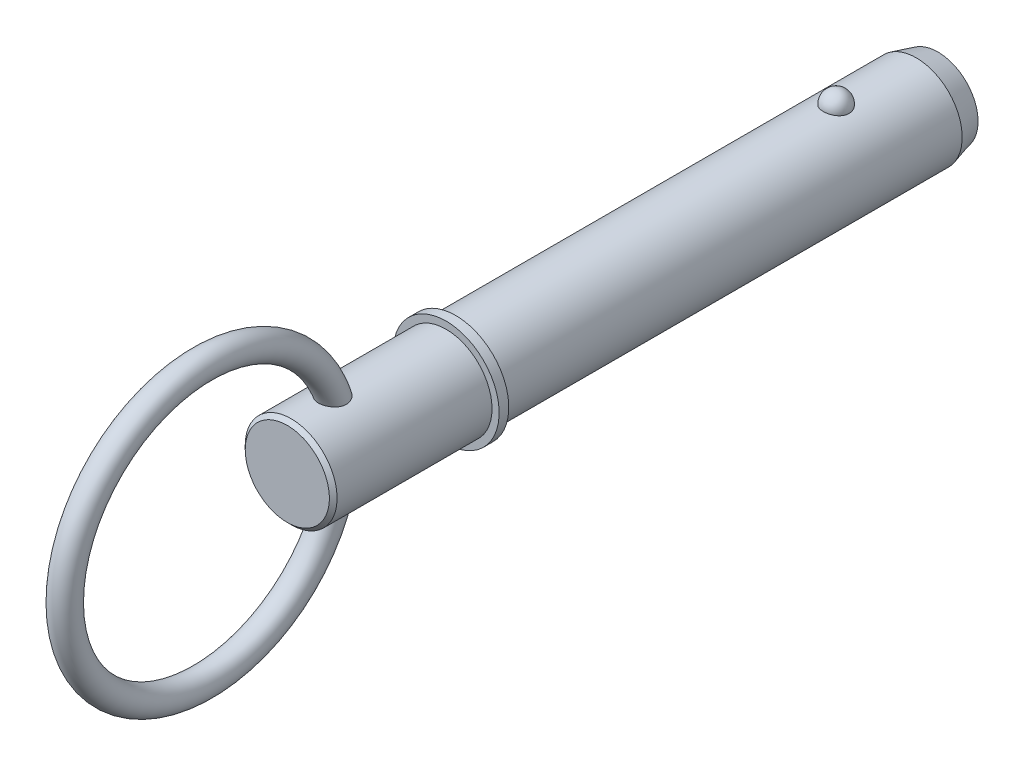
ISO-10303-21;
HEADER;
FILE_DESCRIPTION(('STEP AP214'),'2;1');
FILE_NAME('part.step','',(''),(''),'','','');
FILE_SCHEMA(('AUTOMOTIVE_DESIGN { 1 0 10303 214 1 1 1 1 }'));
ENDSEC;
DATA;
#1=APPLICATION_CONTEXT('core data for automotive mechanical design processes');
#2=APPLICATION_PROTOCOL_DEFINITION('international standard','automotive_design',2000,#1);
#3=PRODUCT_CONTEXT('',#1,'mechanical');
#4=PRODUCT('Part','Part','',(#3));
#5=PRODUCT_RELATED_PRODUCT_CATEGORY('part','',(#4));
#6=PRODUCT_DEFINITION_FORMATION('','',#4);
#7=PRODUCT_DEFINITION_CONTEXT('part definition',#1,'design');
#8=PRODUCT_DEFINITION('design','',#6,#7);
#9=PRODUCT_DEFINITION_SHAPE('','',#8);
#10=(LENGTH_UNIT() NAMED_UNIT(*) SI_UNIT(.MILLI.,.METRE.));
#11=(NAMED_UNIT(*) PLANE_ANGLE_UNIT() SI_UNIT($,.RADIAN.));
#12=(NAMED_UNIT(*) SI_UNIT($,.STERADIAN.) SOLID_ANGLE_UNIT());
#13=UNCERTAINTY_MEASURE_WITH_UNIT(LENGTH_MEASURE(1.E-05),#10,'distance_accuracy_value','');
#14=(GEOMETRIC_REPRESENTATION_CONTEXT(3) GLOBAL_UNCERTAINTY_ASSIGNED_CONTEXT((#13)) GLOBAL_UNIT_ASSIGNED_CONTEXT((#10,
#11,#12)) REPRESENTATION_CONTEXT('',''));
#15=CARTESIAN_POINT('',(0.,0.,0.));
#16=DIRECTION('',(0.,0.,1.));
#17=DIRECTION('',(1.,0.,0.));
#18=AXIS2_PLACEMENT_3D('',#15,#16,#17);
#19=CARTESIAN_POINT('',(0.,0.,76.2));
#20=DIRECTION('',(0.,0.,-1.));
#21=DIRECTION('',(-1.,0.,0.));
#22=AXIS2_PLACEMENT_3D('',#19,#20,#21);
#23=CYLINDRICAL_SURFACE('',#22,9.525);
#24=CARTESIAN_POINT('',(2.66304631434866,9.14515223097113,-2.69));
#25=CARTESIAN_POINT('',(2.66304388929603,9.14515434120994,-2.53964785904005));
#26=CARTESIAN_POINT('',(2.65079171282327,9.14874785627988,-2.389265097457));
#27=CARTESIAN_POINT('',(2.60207590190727,9.16272073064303,-2.09276319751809));
#28=CARTESIAN_POINT('',(2.5656035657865,9.17310252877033,-1.94664561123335));
#29=CARTESIAN_POINT('',(2.469373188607,9.19947238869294,-1.66290124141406));
#30=CARTESIAN_POINT('',(2.40962536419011,9.215457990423,-1.52527076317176));
#31=CARTESIAN_POINT('',(2.26832639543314,9.25124900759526,-1.26225231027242));
#32=CARTESIAN_POINT('',(2.1867756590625,9.27105435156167,-1.1368641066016));
#33=CARTESIAN_POINT('',(2.00344089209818,9.3123948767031,-0.901158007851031));
#34=CARTESIAN_POINT('',(1.90155748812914,9.33393823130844,-0.790918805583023));
#35=CARTESIAN_POINT('',(1.68043702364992,9.37626794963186,-0.589299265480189));
#36=CARTESIAN_POINT('',(1.56119995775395,9.397054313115,-0.497918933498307));
#37=CARTESIAN_POINT('',(1.30893044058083,9.43549335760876,-0.336812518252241));
#38=CARTESIAN_POINT('',(1.17593917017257,9.45315498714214,-0.267024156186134));
#39=CARTESIAN_POINT('',(0.899596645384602,9.48344056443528,-0.150749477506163));
#40=CARTESIAN_POINT('',(0.756246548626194,9.49606507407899,-0.10426056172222));
#41=CARTESIAN_POINT('',(0.466048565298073,9.51468193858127,-0.0365733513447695));
#42=CARTESIAN_POINT('',(0.319312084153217,9.52079100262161,-0.0149294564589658));
#43=CARTESIAN_POINT('',(0.0241592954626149,9.52611235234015,0.00395337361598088));
#44=CARTESIAN_POINT('',(-0.124256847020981,9.5253253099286,0.00119468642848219));
#45=CARTESIAN_POINT('',(-0.416281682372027,9.51700443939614,-0.0284230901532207));
#46=CARTESIAN_POINT('',(-0.559928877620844,9.50956858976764,-0.0549321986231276));
#47=CARTESIAN_POINT('',(-0.840604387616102,9.48887888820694,-0.130816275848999));
#48=CARTESIAN_POINT('',(-0.977632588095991,9.47562493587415,-0.180191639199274));
#49=CARTESIAN_POINT('',(-1.24212223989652,9.44460733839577,-0.300803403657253));
#50=CARTESIAN_POINT('',(-1.36952298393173,9.42681774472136,-0.372166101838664));
#51=CARTESIAN_POINT('',(-1.61053183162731,9.38864858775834,-0.534729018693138));
#52=CARTESIAN_POINT('',(-1.72413851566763,9.36826875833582,-0.625931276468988));
#53=CARTESIAN_POINT('',(-1.9367483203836,9.32666137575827,-0.827716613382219));
#54=CARTESIAN_POINT('',(-2.03542624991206,9.3054250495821,-0.938640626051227));
#55=CARTESIAN_POINT('',(-2.21301001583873,9.26480083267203,-1.17562728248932));
#56=CARTESIAN_POINT('',(-2.29191442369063,9.24541307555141,-1.30169101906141));
#57=CARTESIAN_POINT('',(-2.4288038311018,9.21040769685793,-1.56709947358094));
#58=CARTESIAN_POINT('',(-2.48653332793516,9.19483682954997,-1.7065822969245));
#59=CARTESIAN_POINT('',(-2.57830950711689,9.16952722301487,-1.9936348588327));
#60=CARTESIAN_POINT('',(-2.61235688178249,9.1597883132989,-2.14120436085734));
#61=CARTESIAN_POINT('',(-2.65582131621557,9.14728131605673,-2.43957517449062));
#62=CARTESIAN_POINT('',(-2.66534248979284,9.14448376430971,-2.59036007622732));
#63=CARTESIAN_POINT('',(-2.659816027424,9.1460926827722,-2.89143694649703));
#64=CARTESIAN_POINT('',(-2.64476907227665,9.15049895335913,-3.04172892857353));
#65=CARTESIAN_POINT('',(-2.59062526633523,9.16597303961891,-3.3367616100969));
#66=CARTESIAN_POINT('',(-2.55165119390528,9.17700684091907,-3.48152666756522));
#67=CARTESIAN_POINT('',(-2.45072334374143,9.20447158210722,-3.76226728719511));
#68=CARTESIAN_POINT('',(-2.38876863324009,9.22090274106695,-3.89824249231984));
#69=CARTESIAN_POINT('',(-2.24300082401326,9.25744165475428,-4.15838266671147));
#70=CARTESIAN_POINT('',(-2.15906901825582,9.27756919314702,-4.28247834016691));
#71=CARTESIAN_POINT('',(-1.97161008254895,9.31920445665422,-4.51460755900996));
#72=CARTESIAN_POINT('',(-1.86808218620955,9.34071223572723,-4.62264047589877));
#73=CARTESIAN_POINT('',(-1.64365852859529,9.38280712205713,-4.82005417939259));
#74=CARTESIAN_POINT('',(-1.52269814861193,9.40339041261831,-4.90936239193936));
#75=CARTESIAN_POINT('',(-1.26696810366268,9.44124442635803,-5.06628635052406));
#76=CARTESIAN_POINT('',(-1.13219941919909,9.45851538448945,-5.13390363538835));
#77=CARTESIAN_POINT('',(-0.854427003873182,9.48761400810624,-5.24478918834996));
#78=CARTESIAN_POINT('',(-0.711548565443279,9.49950757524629,-5.28835378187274));
#79=CARTESIAN_POINT('',(-0.420167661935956,9.51684639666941,-5.35116010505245));
#80=CARTESIAN_POINT('',(-0.271665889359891,9.52229244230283,-5.3704048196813));
#81=CARTESIAN_POINT('',(0.0236961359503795,9.52609381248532,-5.38387805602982));
#82=CARTESIAN_POINT('',(0.170533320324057,9.52458300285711,-5.37857884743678));
#83=CARTESIAN_POINT('',(0.461166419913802,9.51494050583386,-5.34419624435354));
#84=CARTESIAN_POINT('',(0.604962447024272,9.50680906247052,-5.31511372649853));
#85=CARTESIAN_POINT('',(0.884899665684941,9.48484202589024,-5.23415185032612));
#86=CARTESIAN_POINT('',(1.02106863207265,9.47102889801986,-5.18236222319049));
#87=CARTESIAN_POINT('',(1.28268503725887,9.43915933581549,-5.05742910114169));
#88=CARTESIAN_POINT('',(1.40813178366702,9.421102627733,-4.98428422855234));
#89=CARTESIAN_POINT('',(1.64690915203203,9.38233399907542,-4.81729201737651));
#90=CARTESIAN_POINT('',(1.76002050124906,9.36158508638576,-4.72313982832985));
#91=CARTESIAN_POINT('',(1.96897358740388,9.31987907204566,-4.5173244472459));
#92=CARTESIAN_POINT('',(2.06481234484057,9.29892193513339,-4.40565824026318));
#93=CARTESIAN_POINT('',(2.23837433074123,9.25869342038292,-4.16566572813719));
#94=CARTESIAN_POINT('',(2.31574652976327,9.23945848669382,-4.03707931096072));
#95=CARTESIAN_POINT('',(2.44818540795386,9.20525491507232,-3.76840633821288));
#96=CARTESIAN_POINT('',(2.50325979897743,9.19028480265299,-3.62832377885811));
#97=CARTESIAN_POINT('',(2.58510224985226,9.16757716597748,-3.35610038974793));
#98=CARTESIAN_POINT('',(2.61427951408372,9.15923447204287,-3.22472833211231));
#99=CARTESIAN_POINT('',(2.6532524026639,9.14802112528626,-2.95891229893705));
#100=CARTESIAN_POINT('',(2.66304848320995,9.1451503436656,-2.82446839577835));
#101=CARTESIAN_POINT('',(2.66304631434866,9.14515223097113,-2.69));
#102=B_SPLINE_CURVE_WITH_KNOTS('',3,(#24,#25,#26,#27,#28,#29,#30,#31,#32,#33,#34,#35,#36,#37,
#38,#39,#40,#41,#42,#43,#44,#45,#46,#47,#48,#49,#50,#51,#52,#53,#54,#55,#56,#57,#58,#59,#60,#61,
#62,#63,#64,#65,#66,#67,#68,#69,#70,#71,#72,#73,#74,#75,#76,#77,#78,#79,#80,#81,#82,#83,#84,#85,
#86,#87,#88,#89,#90,#91,#92,#93,#94,#95,#96,#97,#98,#99,#100,#101),.UNSPECIFIED.,.T.,.F.,(4,2,2,
2,2,2,2,2,2,2,2,2,2,2,2,2,2,2,2,2,2,2,2,2,2,2,2,2,2,2,2,2,2,2,2,2,2,2,4),(0.,0.450573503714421,
0.901308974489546,1.35184682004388,1.80237623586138,2.25516399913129,2.70795190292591,
3.15942136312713,3.61084044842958,4.0540301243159,4.49717661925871,4.9338984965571,
5.37062791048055,5.80991423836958,6.24924573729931,6.69708004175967,7.1449466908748,
7.5980522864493,8.0511446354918,8.50231041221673,8.95346368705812,9.40232106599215,
9.85119666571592,10.3025487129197,10.7539184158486,11.2070064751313,11.6600623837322,
12.1074045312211,12.5546917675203,12.9934085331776,13.4321091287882,13.8690915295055,
14.3061021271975,14.7499227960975,15.1938199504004,15.6455814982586,16.0971866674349,
16.5001694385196,16.9031427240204),.UNSPECIFIED.);
#103=CARTESIAN_POINT('',(2.66304631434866,9.14515223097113,-2.69));
#104=VERTEX_POINT('',#103);
#105=EDGE_CURVE('E101',#104,#104,#102,.T.);
#106=ORIENTED_EDGE('',*,*,#105,.T.);
#107=EDGE_LOOP('',(#106));
#108=FACE_BOUND('',#107,.T.);
#109=CARTESIAN_POINT('',(0.,0.,-19.3000000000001));
#110=DIRECTION('',(0.,0.,-1.));
#111=DIRECTION('',(-1.,0.,0.));
#112=AXIS2_PLACEMENT_3D('',#109,#110,#111);
#113=CIRCLE('',#112,9.525);
#114=CARTESIAN_POINT('',(-9.525,0.,-19.3000000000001));
#115=VERTEX_POINT('',#114);
#116=EDGE_CURVE('E109',#115,#115,#113,.F.);
#117=ORIENTED_EDGE('',*,*,#116,.T.);
#118=EDGE_LOOP('',(#117));
#119=FACE_BOUND('',#118,.T.);
#120=CARTESIAN_POINT('',(0.,0.,76.2));
#121=DIRECTION('',(0.,0.,1.));
#122=DIRECTION('',(1.,0.,0.));
#123=AXIS2_PLACEMENT_3D('',#120,#121,#122);
#124=CIRCLE('',#123,9.525);
#125=CARTESIAN_POINT('',(9.525,0.,76.2));
#126=VERTEX_POINT('',#125);
#127=EDGE_CURVE('E107',#126,#126,#124,.T.);
#128=ORIENTED_EDGE('',*,*,#127,.F.);
#129=EDGE_LOOP('',(#128));
#130=FACE_BOUND('',#129,.T.);
#131=ADVANCED_FACE('F39',(#108,#119,#130),#23,.T.);
#132=CARTESIAN_POINT('',(0.,0.,-23.8));
#133=DIRECTION('',(0.,0.,-1.));
#134=DIRECTION('',(-1.,0.,0.));
#135=AXIS2_PLACEMENT_3D('',#132,#133,#134);
#136=PLANE('',#135);
#137=CARTESIAN_POINT('',(0.,0.,-23.8));
#138=DIRECTION('',(0.,0.,-1.));
#139=DIRECTION('',(-1.,0.,0.));
#140=AXIS2_PLACEMENT_3D('',#137,#138,#139);
#141=CIRCLE('',#140,8.31922863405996);
#142=CARTESIAN_POINT('',(-8.31922863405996,0.,-23.8));
#143=VERTEX_POINT('',#142);
#144=EDGE_CURVE('E142',#143,#143,#141,.T.);
#145=ORIENTED_EDGE('',*,*,#144,.T.);
#146=EDGE_LOOP('',(#145));
#147=FACE_BOUND('',#146,.T.);
#148=ADVANCED_FACE('F87',(#147),#136,.T.);
#149=CARTESIAN_POINT('',(0.,0.,-23.8));
#150=DIRECTION('',(0.,0.,1.));
#151=DIRECTION('',(1.,0.,0.));
#152=AXIS2_PLACEMENT_3D('',#149,#150,#151);
#153=CONICAL_SURFACE('',#152,8.31922863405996,0.26179938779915);
#154=ORIENTED_EDGE('',*,*,#116,.F.);
#155=EDGE_LOOP('',(#154));
#156=FACE_BOUND('',#155,.T.);
#157=ORIENTED_EDGE('',*,*,#144,.F.);
#158=EDGE_LOOP('',(#157));
#159=FACE_BOUND('',#158,.T.);
#160=ADVANCED_FACE('F93',(#156,#159),#153,.T.);
#161=CARTESIAN_POINT('',(0.,9.525,-2.69));
#162=DIRECTION('',(0.,1.,0.));
#163=DIRECTION('',(0.,0.,1.));
#164=AXIS2_PLACEMENT_3D('',#161,#162,#163);
#165=SPHERICAL_SURFACE('',#164,2.69);
#166=ORIENTED_EDGE('',*,*,#105,.F.);
#167=EDGE_LOOP('',(#166));
#168=FACE_BOUND('',#167,.T.);
#169=ADVANCED_FACE('F112',(#168),#165,.T.);
#170=CARTESIAN_POINT('',(0.,0.,76.2));
#171=DIRECTION('',(0.,0.,-1.));
#172=DIRECTION('',(-1.,0.,0.));
#173=AXIS2_PLACEMENT_3D('',#170,#171,#172);
#174=PLANE('',#173);
#175=ORIENTED_EDGE('',*,*,#127,.T.);
#176=EDGE_LOOP('',(#175));
#177=FACE_BOUND('',#176,.T.);
#178=CARTESIAN_POINT('',(0.,0.,76.2));
#179=DIRECTION('',(0.,0.,-1.));
#180=DIRECTION('',(-1.,0.,0.));
#181=AXIS2_PLACEMENT_3D('',#178,#179,#180);
#182=CIRCLE('',#181,11.);
#183=CARTESIAN_POINT('',(-11.,0.,76.2));
#184=VERTEX_POINT('',#183);
#185=EDGE_CURVE('E108',#184,#184,#182,.T.);
#186=ORIENTED_EDGE('',*,*,#185,.T.);
#187=EDGE_LOOP('',(#186));
#188=FACE_BOUND('',#187,.T.);
#189=ADVANCED_FACE('F116',(#177,#188),#174,.T.);
#190=CARTESIAN_POINT('',(0.,0.,33.7287874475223));
#191=DIRECTION('',(0.,0.,-1.));
#192=DIRECTION('',(-1.,0.,0.));
#193=AXIS2_PLACEMENT_3D('',#190,#191,#192);
#194=CYLINDRICAL_SURFACE('',#193,11.);
#195=CARTESIAN_POINT('',(0.,0.,78.2));
#196=DIRECTION('',(0.,0.,-1.));
#197=DIRECTION('',(-1.,0.,0.));
#198=AXIS2_PLACEMENT_3D('',#195,#196,#197);
#199=CIRCLE('',#198,11.);
#200=CARTESIAN_POINT('',(-11.,0.,78.2));
#201=VERTEX_POINT('',#200);
#202=EDGE_CURVE('E133',#201,#201,#199,.T.);
#203=ORIENTED_EDGE('',*,*,#202,.T.);
#204=EDGE_LOOP('',(#203));
#205=FACE_BOUND('',#204,.T.);
#206=ORIENTED_EDGE('',*,*,#185,.F.);
#207=EDGE_LOOP('',(#206));
#208=FACE_BOUND('',#207,.T.);
#209=ADVANCED_FACE('F120',(#205,#208),#194,.T.);
#210=CARTESIAN_POINT('',(0.,11.,78.2));
#211=DIRECTION('',(0.,0.,1.));
#212=DIRECTION('',(1.,0.,0.));
#213=AXIS2_PLACEMENT_3D('',#210,#211,#212);
#214=PLANE('',#213);
#215=CARTESIAN_POINT('',(0.,0.,78.2));
#216=DIRECTION('',(0.,0.,1.));
#217=DIRECTION('',(1.,0.,0.));
#218=AXIS2_PLACEMENT_3D('',#215,#216,#217);
#219=CIRCLE('',#218,9.525);
#220=CARTESIAN_POINT('',(9.525,0.,78.2));
#221=VERTEX_POINT('',#220);
#222=EDGE_CURVE('E111',#221,#221,#219,.T.);
#223=ORIENTED_EDGE('',*,*,#222,.F.);
#224=EDGE_LOOP('',(#223));
#225=FACE_BOUND('',#224,.T.);
#226=ORIENTED_EDGE('',*,*,#202,.F.);
#227=EDGE_LOOP('',(#226));
#228=FACE_BOUND('',#227,.T.);
#229=ADVANCED_FACE('F84',(#225,#228),#214,.T.);
#230=CARTESIAN_POINT('',(0.,0.,111.13));
#231=DIRECTION('',(0.,0.,-1.));
#232=DIRECTION('',(-1.,0.,0.));
#233=AXIS2_PLACEMENT_3D('',#230,#231,#232);
#234=CYLINDRICAL_SURFACE('',#233,9.525);
#235=CARTESIAN_POINT('',(-1.17255022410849,-9.45255262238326,99.1156813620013));
#236=CARTESIAN_POINT('',(-1.03279041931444,-9.46988901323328,99.0520581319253));
#237=CARTESIAN_POINT('',(-0.887457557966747,-9.48474288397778,99.0000360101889));
#238=CARTESIAN_POINT('',(-0.589790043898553,-9.50789357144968,98.9203017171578));
#239=CARTESIAN_POINT('',(-0.437456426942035,-9.51619135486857,98.8925859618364));
#240=CARTESIAN_POINT('',(-0.130095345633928,-9.52535230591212,98.862037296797));
#241=CARTESIAN_POINT('',(0.0249321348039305,-9.52621542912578,98.8592045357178));
#242=CARTESIAN_POINT('',(0.333291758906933,-9.5204161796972,98.8784804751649));
#243=CARTESIAN_POINT('',(0.486623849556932,-9.51375357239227,98.9005899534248));
#244=CARTESIAN_POINT('',(0.787326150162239,-9.49360162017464,98.9693091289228));
#245=CARTESIAN_POINT('',(0.934692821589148,-9.48010828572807,99.0159331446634));
#246=CARTESIAN_POINT('',(1.2191706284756,-9.44773819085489,99.132695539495));
#247=CARTESIAN_POINT('',(1.35628163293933,-9.42886136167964,99.2028342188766));
#248=CARTESIAN_POINT('',(1.61597534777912,-9.38783836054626,99.3648586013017));
#249=CARTESIAN_POINT('',(1.73859309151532,-9.36570037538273,99.4566901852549));
#250=CARTESIAN_POINT('',(1.96611924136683,-9.32059424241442,99.6599834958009));
#251=CARTESIAN_POINT('',(2.07103000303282,-9.29762620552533,99.7714426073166));
#252=CARTESIAN_POINT('',(2.25895856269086,-9.25375378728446,100.009567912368));
#253=CARTESIAN_POINT('',(2.34223089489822,-9.23282741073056,100.136029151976));
#254=CARTESIAN_POINT('',(2.48638570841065,-9.19505802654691,100.401654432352));
#255=CARTESIAN_POINT('',(2.54727152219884,-9.17821441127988,100.540816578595));
#256=CARTESIAN_POINT('',(2.64504150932,-9.15051673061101,100.826450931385));
#257=CARTESIAN_POINT('',(2.68213620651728,-9.13961026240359,100.97284631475));
#258=CARTESIAN_POINT('',(2.73308631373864,-9.1245038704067,101.269935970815));
#259=CARTESIAN_POINT('',(2.74693762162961,-9.12030513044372,101.420630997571));
#260=CARTESIAN_POINT('',(2.75225289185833,-9.11870262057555,101.728204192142));
#261=CARTESIAN_POINT('',(2.742835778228,-9.12156626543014,101.885097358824));
#262=CARTESIAN_POINT('',(2.70120500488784,-9.13397864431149,102.195530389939));
#263=CARTESIAN_POINT('',(2.66898313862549,-9.14352978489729,102.349069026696));
#264=CARTESIAN_POINT('',(2.57915721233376,-9.1692947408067,102.664317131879));
#265=CARTESIAN_POINT('',(2.5193838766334,-9.18606757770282,102.82536274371));
#266=CARTESIAN_POINT('',(2.37615490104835,-9.22415241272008,103.136112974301));
#267=CARTESIAN_POINT('',(2.29267648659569,-9.2454687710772,103.285806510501));
#268=CARTESIAN_POINT('',(2.09570343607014,-9.29218719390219,103.582005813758));
#269=CARTESIAN_POINT('',(1.98029238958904,-9.31778152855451,103.727215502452));
#270=CARTESIAN_POINT('',(1.72523060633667,-9.36835235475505,103.994631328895));
#271=CARTESIAN_POINT('',(1.58560973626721,-9.39332956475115,104.11686542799));
#272=CARTESIAN_POINT('',(1.31999418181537,-9.43381163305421,104.306542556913));
#273=CARTESIAN_POINT('',(1.1984987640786,-9.45016352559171,104.380111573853));
#274=CARTESIAN_POINT('',(0.944726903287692,-9.47889043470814,104.506555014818));
#275=CARTESIAN_POINT('',(0.812460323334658,-9.4912690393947,104.55944811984));
#276=CARTESIAN_POINT('',(0.539385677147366,-9.51070487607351,104.641579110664));
#277=CARTESIAN_POINT('',(0.398529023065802,-9.51772807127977,104.670665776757));
#278=CARTESIAN_POINT('',(0.113692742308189,-9.52538430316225,104.70234627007));
#279=CARTESIAN_POINT('',(-0.0302854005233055,-9.52602031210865,104.704952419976));
#280=CARTESIAN_POINT('',(-0.30106744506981,-9.52110324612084,104.684638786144));
#281=CARTESIAN_POINT('',(-0.428091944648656,-9.51619084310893,104.664361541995));
#282=CARTESIAN_POINT('',(-0.676960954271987,-9.50173118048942,104.603770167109));
#283=CARTESIAN_POINT('',(-0.798804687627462,-9.49218322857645,104.563453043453));
#284=CARTESIAN_POINT('',(-1.03743276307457,-9.4691126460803,104.463797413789));
#285=CARTESIAN_POINT('',(-1.15402581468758,-9.45550022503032,104.404026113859));
#286=CARTESIAN_POINT('',(-1.37707059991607,-9.42560278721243,104.268465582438));
#287=CARTESIAN_POINT('',(-1.48351822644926,-9.40931669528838,104.192669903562));
#288=CARTESIAN_POINT('',(-1.70022776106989,-9.37276249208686,104.015206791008));
#289=CARTESIAN_POINT('',(-1.80866644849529,-9.35226352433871,103.911363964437));
#290=CARTESIAN_POINT('',(-2.00947431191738,-9.31118474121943,103.68916467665));
#291=CARTESIAN_POINT('',(-2.1018320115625,-9.29060487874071,103.570797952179));
#292=CARTESIAN_POINT('',(-2.28343646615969,-9.24779116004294,103.301723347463));
#293=CARTESIAN_POINT('',(-2.36963977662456,-9.22584708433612,103.148904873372));
#294=CARTESIAN_POINT('',(-2.51731958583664,-9.18665215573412,102.831108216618));
#295=CARTESIAN_POINT('',(-2.57878214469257,-9.16940395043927,102.666123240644));
#296=CARTESIAN_POINT('',(-2.67771284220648,-9.14102404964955,102.317906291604));
#297=CARTESIAN_POINT('',(-2.71355979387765,-9.13031106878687,102.134171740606));
#298=CARTESIAN_POINT('',(-2.75239325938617,-9.11868499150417,101.762939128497));
#299=CARTESIAN_POINT('',(-2.75540326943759,-9.11776488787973,101.575443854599));
#300=CARTESIAN_POINT('',(-2.72755769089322,-9.12612848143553,101.218233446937));
#301=CARTESIAN_POINT('',(-2.69938579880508,-9.1346036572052,101.048293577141));
#302=CARTESIAN_POINT('',(-2.6128234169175,-9.15973790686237,100.71694195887));
#303=CARTESIAN_POINT('',(-2.55445306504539,-9.17639152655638,100.555524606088));
#304=CARTESIAN_POINT('',(-2.41575064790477,-9.21381352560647,100.262262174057));
#305=CARTESIAN_POINT('',(-2.33810564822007,-9.23402440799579,100.129067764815));
#306=CARTESIAN_POINT('',(-2.16110598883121,-9.27704240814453,99.8784363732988));
#307=CARTESIAN_POINT('',(-2.06174995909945,-9.29984968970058,99.76100038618));
#308=CARTESIAN_POINT('',(-1.84046167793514,-9.3462023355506,99.5414448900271));
#309=CARTESIAN_POINT('',(-1.71787459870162,-9.36974632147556,99.43998498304));
#310=CARTESIAN_POINT('',(-1.45637301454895,-9.41393415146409,99.2600854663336));
#311=CARTESIAN_POINT('',(-1.31745717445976,-9.43457775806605,99.1816477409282));
#312=CARTESIAN_POINT('',(-1.17255022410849,-9.45255262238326,99.1156813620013));
#313=B_SPLINE_CURVE_WITH_KNOTS('',3,(#235,#236,#237,#238,#239,#240,#241,#242,#243,#244,#245,
#246,#247,#248,#249,#250,#251,#252,#253,#254,#255,#256,#257,#258,#259,#260,#261,#262,#263,#264,
#265,#266,#267,#268,#269,#270,#271,#272,#273,#274,#275,#276,#277,#278,#279,#280,#281,#282,#283,
#284,#285,#286,#287,#288,#289,#290,#291,#292,#293,#294,#295,#296,#297,#298,#299,#300,#301,#302,
#303,#304,#305,#306,#307,#308,#309,#310,#311,#312),.UNSPECIFIED.,.T.,.F.,(4,2,2,2,2,2,2,2,2,2,2,
2,2,2,2,2,2,2,2,2,2,2,2,2,2,2,2,2,2,2,2,2,2,2,2,2,2,2,4),(0.,0.463035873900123,
0.926003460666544,1.38897381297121,1.85195860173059,2.31521411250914,2.77847553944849,
3.24059321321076,3.70264936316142,4.15899535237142,4.61527338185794,5.06745604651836,
5.51971850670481,5.98936669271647,6.45918397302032,6.9748286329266,7.49097038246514,
8.04995658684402,8.60825803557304,9.03545685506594,9.46226879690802,9.89177127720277,
10.3210738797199,10.7054535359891,11.0898906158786,11.4835430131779,11.8773540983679,
12.3302409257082,12.7834496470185,13.3116493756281,13.8401462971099,14.3996817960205,
14.9588168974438,15.4733264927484,15.9874934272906,16.451669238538,16.915874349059,
17.3959238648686,17.8760126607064),.UNSPECIFIED.);
#314=CARTESIAN_POINT('',(-1.17255022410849,-9.45255262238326,99.1156813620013));
#315=VERTEX_POINT('',#314);
#316=EDGE_CURVE('E10',#315,#315,#313,.T.);
#317=ORIENTED_EDGE('',*,*,#316,.F.);
#318=EDGE_LOOP('',(#317));
#319=FACE_BOUND('',#318,.T.);
#320=CARTESIAN_POINT('',(-1.17255022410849,9.45255262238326,99.1156813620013));
#321=CARTESIAN_POINT('',(-1.31058061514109,9.43543238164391,99.1785143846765));
#322=CARTESIAN_POINT('',(-1.44315063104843,9.41589375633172,99.2526513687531));
#323=CARTESIAN_POINT('',(-1.69365345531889,9.37407591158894,99.4218923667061));
#324=CARTESIAN_POINT('',(-1.81158925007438,9.35179725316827,99.5169920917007));
#325=CARTESIAN_POINT('',(-2.02956633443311,9.30692788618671,99.7259676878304));
#326=CARTESIAN_POINT('',(-2.12959463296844,9.28433696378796,99.8398570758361));
#327=CARTESIAN_POINT('',(-2.30883055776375,9.24139869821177,100.08334578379));
#328=CARTESIAN_POINT('',(-2.38804080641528,9.22105107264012,100.212943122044));
#329=CARTESIAN_POINT('',(-2.52289811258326,9.18506690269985,100.482637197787));
#330=CARTESIAN_POINT('',(-2.57879510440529,9.16938093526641,100.622602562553));
#331=CARTESIAN_POINT('',(-2.66732862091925,9.14402087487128,100.910194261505));
#332=CARTESIAN_POINT('',(-2.6999643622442,9.13434698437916,101.057820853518));
#333=CARTESIAN_POINT('',(-2.74234854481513,9.12171311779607,101.358709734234));
#334=CARTESIAN_POINT('',(-2.75176419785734,9.11885078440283,101.512022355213));
#335=CARTESIAN_POINT('',(-2.74768995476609,9.12007747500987,101.818282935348));
#336=CARTESIAN_POINT('',(-2.73419331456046,9.12416854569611,101.971230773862));
#337=CARTESIAN_POINT('',(-2.68381401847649,9.13911977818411,102.285048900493));
#338=CARTESIAN_POINT('',(-2.64520186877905,9.15047943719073,102.445615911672));
#339=CARTESIAN_POINT('',(-2.54485320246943,9.17889121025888,102.758878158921));
#340=CARTESIAN_POINT('',(-2.48309922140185,9.19594762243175,102.911567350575));
#341=CARTESIAN_POINT('',(-2.33056913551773,9.23584987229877,103.221122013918));
#342=CARTESIAN_POINT('',(-2.23745101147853,9.25911216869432,103.376784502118));
#343=CARTESIAN_POINT('',(-2.02674425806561,9.307501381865,103.670279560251));
#344=CARTESIAN_POINT('',(-1.90916388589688,9.33262766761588,103.808118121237));
#345=CARTESIAN_POINT('',(-1.67044606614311,9.37804498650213,104.042015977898));
#346=CARTESIAN_POINT('',(-1.55243875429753,9.39849934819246,104.141240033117));
#347=CARTESIAN_POINT('',(-1.30125310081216,9.43654625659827,104.319193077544));
#348=CARTESIAN_POINT('',(-1.16808326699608,9.45414039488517,104.397933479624));
#349=CARTESIAN_POINT('',(-0.958516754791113,9.47691412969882,104.497606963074));
#350=CARTESIAN_POINT('',(-0.886649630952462,9.48392776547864,104.527860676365));
#351=CARTESIAN_POINT('',(-0.740281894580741,9.49647248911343,104.581484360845));
#352=CARTESIAN_POINT('',(-0.665782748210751,9.50200438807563,104.604858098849));
#353=CARTESIAN_POINT('',(-0.514804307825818,9.51137811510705,104.6442294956));
#354=CARTESIAN_POINT('',(-0.438326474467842,9.51522115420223,104.660232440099));
#355=CARTESIAN_POINT('',(-0.284116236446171,9.52107513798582,104.684532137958));
#356=CARTESIAN_POINT('',(-0.206384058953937,9.52308641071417,104.692830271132));
#357=CARTESIAN_POINT('',(0.00463957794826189,9.5259225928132,104.70454519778));
#358=CARTESIAN_POINT('',(0.138460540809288,9.52491109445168,104.700394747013));
#359=CARTESIAN_POINT('',(0.403152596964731,9.51738801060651,104.669251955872));
#360=CARTESIAN_POINT('',(0.534023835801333,9.51087669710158,104.642260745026));
#361=CARTESIAN_POINT('',(0.783985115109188,9.49347484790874,104.568806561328));
#362=CARTESIAN_POINT('',(0.903337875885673,9.48277338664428,104.523181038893));
#363=CARTESIAN_POINT('',(1.13363663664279,9.45800893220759,104.414928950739));
#364=CARTESIAN_POINT('',(1.24458027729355,9.44394500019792,104.352297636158));
#365=CARTESIAN_POINT('',(1.46880911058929,9.41182796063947,104.204389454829));
#366=CARTESIAN_POINT('',(1.58087386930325,9.3935013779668,104.117328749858));
#367=CARTESIAN_POINT('',(1.79132420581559,9.35565274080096,103.928247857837));
#368=CARTESIAN_POINT('',(1.88970126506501,9.33612995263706,103.826218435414));
#369=CARTESIAN_POINT('',(2.08778125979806,9.29401761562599,103.590997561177));
#370=CARTESIAN_POINT('',(2.18473298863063,9.27148591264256,103.45547341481));
#371=CARTESIAN_POINT('',(2.35733954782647,9.22911075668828,103.171030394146));
#372=CARTESIAN_POINT('',(2.43297838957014,9.20926932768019,103.022101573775));
#373=CARTESIAN_POINT('',(2.56843139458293,9.17247322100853,102.697269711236));
#374=CARTESIAN_POINT('',(2.6256192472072,9.15606955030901,102.520196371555));
#375=CARTESIAN_POINT('',(2.70930664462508,9.13166037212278,102.158330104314));
#376=CARTESIAN_POINT('',(2.73581406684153,9.12365270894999,101.973539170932));
#377=CARTESIAN_POINT('',(2.7551261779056,9.11784049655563,101.609017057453));
#378=CARTESIAN_POINT('',(2.74917791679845,9.11965839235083,101.429361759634));
#379=CARTESIAN_POINT('',(2.70473277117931,9.13294027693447,101.074499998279));
#380=CARTESIAN_POINT('',(2.66626406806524,9.14439591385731,100.899289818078));
#381=CARTESIAN_POINT('',(2.56263844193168,9.17393184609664,100.578469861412));
#382=CARTESIAN_POINT('',(2.50080069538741,9.19116614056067,100.431704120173));
#383=CARTESIAN_POINT('',(2.3524484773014,9.23024728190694,100.15189992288));
#384=CARTESIAN_POINT('',(2.26593972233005,9.25209305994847,100.018858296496));
#385=CARTESIAN_POINT('',(2.07585352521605,9.29652853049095,99.7771451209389));
#386=CARTESIAN_POINT('',(1.97340753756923,9.31901931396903,99.6675620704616));
#387=CARTESIAN_POINT('',(1.75142335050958,9.36327537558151,99.467179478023));
#388=CARTESIAN_POINT('',(1.63188535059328,9.38504066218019,99.3763797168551));
#389=CARTESIAN_POINT('',(1.37826267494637,9.42563474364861,99.2151683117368));
#390=CARTESIAN_POINT('',(1.24409194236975,9.44444438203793,99.1448873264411));
#391=CARTESIAN_POINT('',(0.965562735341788,9.47697010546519,99.0269968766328));
#392=CARTESIAN_POINT('',(0.821203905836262,9.4906860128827,98.9793882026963));
#393=CARTESIAN_POINT('',(0.524366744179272,9.51173338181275,98.9073692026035));
#394=CARTESIAN_POINT('',(0.371807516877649,9.5189799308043,98.8832670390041));
#395=CARTESIAN_POINT('',(0.0646112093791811,9.52602042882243,98.8598425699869));
#396=CARTESIAN_POINT('',(-0.0900262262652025,9.52581308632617,98.8605245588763));
#397=CARTESIAN_POINT('',(-0.404139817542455,9.51777767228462,98.8872769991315));
#398=CARTESIAN_POINT('',(-0.563508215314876,9.50959696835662,98.9145222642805));
#399=CARTESIAN_POINT('',(-0.874799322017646,9.48602809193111,98.9955333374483));
#400=CARTESIAN_POINT('',(-1.02672214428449,9.47064002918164,99.0492987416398));
#401=CARTESIAN_POINT('',(-1.17255022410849,9.45255262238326,99.1156813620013));
#402=B_SPLINE_CURVE_WITH_KNOTS('',3,(#320,#321,#322,#323,#324,#325,#326,#327,#328,#329,#330,
#331,#332,#333,#334,#335,#336,#337,#338,#339,#340,#341,#342,#343,#344,#345,#346,#347,#348,#349,
#350,#351,#352,#353,#354,#355,#356,#357,#358,#359,#360,#361,#362,#363,#364,#365,#366,#367,#368,
#369,#370,#371,#372,#373,#374,#375,#376,#377,#378,#379,#380,#381,#382,#383,#384,#385,#386,#387,
#388,#389,#390,#391,#392,#393,#394,#395,#396,#397,#398,#399,#400,#401),.UNSPECIFIED.,.T.,.F.,(4,
2,2,2,2,2,2,2,2,2,2,2,2,2,2,2,2,2,2,2,2,2,2,2,2,2,2,2,2,2,2,2,2,2,2,2,2,2,2,2,4),(0.,
0.457306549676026,0.914519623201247,1.37206305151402,1.82954881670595,2.28199545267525,
2.73445732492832,3.19336710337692,3.65241198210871,4.14699278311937,4.64194758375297,
5.18812269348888,5.73411374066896,6.19889752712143,6.66342179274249,6.89799214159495,
7.13243382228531,7.36670711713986,7.60093844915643,8.00032434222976,8.39969048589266,
8.78279802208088,9.16601265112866,9.59366701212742,10.0215863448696,10.5240084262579,
11.0268064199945,11.5844522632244,12.1419548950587,12.6781910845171,13.213963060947,
13.6920531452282,14.1700325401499,14.6229745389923,15.0759112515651,15.5316722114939,
15.9874490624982,16.4491237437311,16.9108784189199,17.3940267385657,17.8771677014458),.UNSPECIFIED.);
#403=CARTESIAN_POINT('',(-1.17255022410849,9.45255262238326,99.1156813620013));
#404=VERTEX_POINT('',#403);
#405=EDGE_CURVE('E51',#404,#404,#402,.T.);
#406=ORIENTED_EDGE('',*,*,#405,.F.);
#407=EDGE_LOOP('',(#406));
#408=FACE_BOUND('',#407,.T.);
#409=CARTESIAN_POINT('',(0.,0.,110.33));
#410=DIRECTION('',(0.,0.,-1.));
#411=DIRECTION('',(-1.,0.,0.));
#412=AXIS2_PLACEMENT_3D('',#409,#410,#411);
#413=CIRCLE('',#412,9.525);
#414=CARTESIAN_POINT('',(-9.525,0.,110.33));
#415=VERTEX_POINT('',#414);
#416=EDGE_CURVE('E63',#415,#415,#413,.T.);
#417=ORIENTED_EDGE('',*,*,#416,.T.);
#418=EDGE_LOOP('',(#417));
#419=FACE_BOUND('',#418,.T.);
#420=ORIENTED_EDGE('',*,*,#222,.T.);
#421=EDGE_LOOP('',(#420));
#422=FACE_BOUND('',#421,.T.);
#423=ADVANCED_FACE('F68',(#319,#408,#419,#422),#234,.T.);
#424=CARTESIAN_POINT('',(0.,0.,111.13));
#425=DIRECTION('',(0.,0.,-1.));
#426=DIRECTION('',(-1.,0.,0.));
#427=AXIS2_PLACEMENT_3D('',#424,#425,#426);
#428=PLANE('',#427);
#429=CARTESIAN_POINT('',(0.,0.,111.13));
#430=DIRECTION('',(0.,0.,-1.));
#431=DIRECTION('',(-1.,0.,0.));
#432=AXIS2_PLACEMENT_3D('',#429,#430,#431);
#433=CIRCLE('',#432,8.72499999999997);
#434=CARTESIAN_POINT('',(-8.72499999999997,0.,111.13));
#435=VERTEX_POINT('',#434);
#436=EDGE_CURVE('E57',#435,#435,#433,.F.);
#437=ORIENTED_EDGE('',*,*,#436,.T.);
#438=EDGE_LOOP('',(#437));
#439=FACE_BOUND('',#438,.T.);
#440=ADVANCED_FACE('F75',(#439),#428,.F.);
#441=CARTESIAN_POINT('',(0.,0.,110.33));
#442=DIRECTION('',(0.,0.,-1.));
#443=DIRECTION('',(-1.,0.,0.));
#444=AXIS2_PLACEMENT_3D('',#441,#442,#443);
#445=CONICAL_SURFACE('',#444,9.525,0.785398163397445);
#446=ORIENTED_EDGE('',*,*,#436,.F.);
#447=EDGE_LOOP('',(#446));
#448=FACE_BOUND('',#447,.T.);
#449=ORIENTED_EDGE('',*,*,#416,.F.);
#450=EDGE_LOOP('',(#449));
#451=FACE_BOUND('',#450,.T.);
#452=ADVANCED_FACE('F41',(#448,#451),#445,.T.);
#453=CARTESIAN_POINT('',(0.,0.,128.705));
#454=DIRECTION('',(1.,0.,0.));
#455=DIRECTION('',(0.,0.,-1.));
#456=AXIS2_PLACEMENT_3D('',#453,#454,#455);
#457=TOROIDAL_SURFACE('',#456,28.575,2.75);
#458=ORIENTED_EDGE('',*,*,#316,.T.);
#459=EDGE_LOOP('',(#458));
#460=FACE_BOUND('',#459,.T.);
#461=ORIENTED_EDGE('',*,*,#405,.T.);
#462=EDGE_LOOP('',(#461));
#463=FACE_BOUND('',#462,.T.);
#464=ADVANCED_FACE('F72',(#460,#463),#457,.T.);
#465=CLOSED_SHELL('',(#131,#148,#160,#169,#189,#209,#229,#423,#440,#452,#464));
#466=MANIFOLD_SOLID_BREP('B2',#465);
#467=ADVANCED_BREP_SHAPE_REPRESENTATION('',(#18,#466),#14);
#468=SHAPE_DEFINITION_REPRESENTATION(#9,#467);
ENDSEC;
END-ISO-10303-21;
